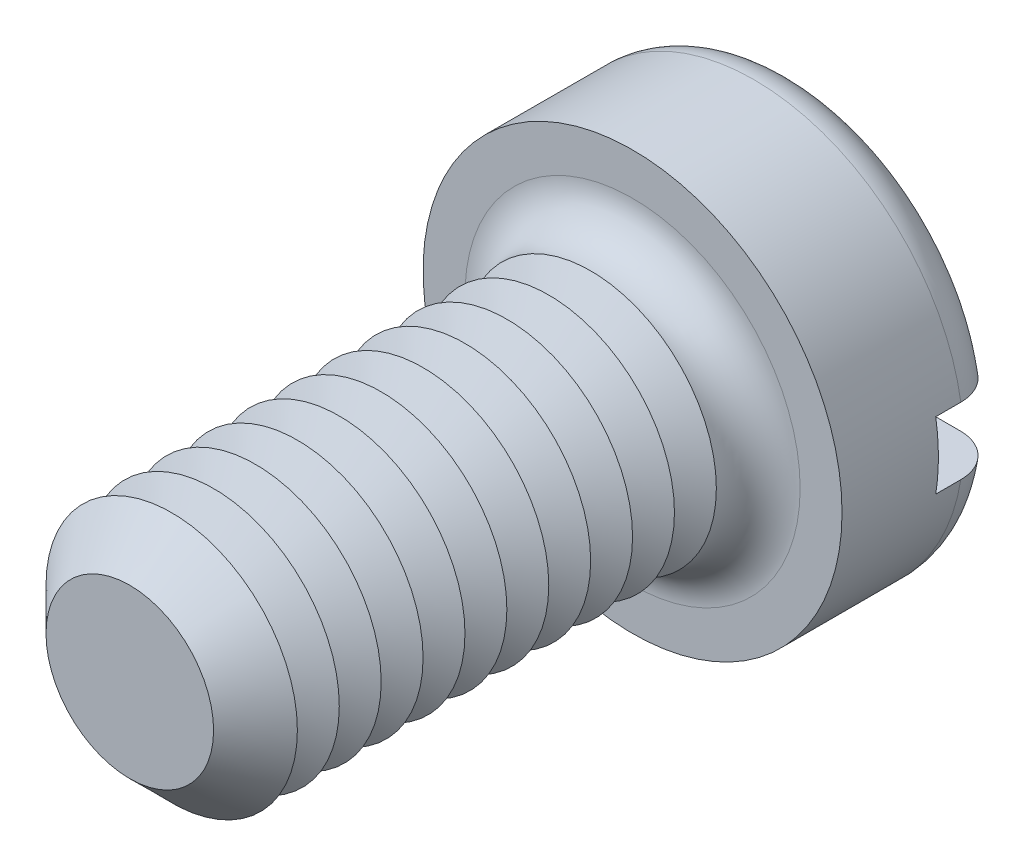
from build123d import *

# Parameters (mm, degrees)
SKETCH3_R           = 5
BOSS_EXTRUDE2_DEPTH = 3.9
SKETCH4_R           = 3
BOSS_EXTRUDE3_DEPTH = 12
FILLET1_R           = 1
CHAMFER1_SIZE       = 1
LPATTERN1_COUNT     = 10
LPATTERN1_PITCH     = 1
SKETCH8_W           = 10
SKETCH8_H           = 1.6
CUT_EXTRUDE1_DEPTH  = 1.6


with BuildPart() as part:
    # Sketch3 → Boss-Extrude2 (new body)
    with BuildSketch(Plane.XY):
        Circle(SKETCH3_R)
    extrude(amount=-BOSS_EXTRUDE2_DEPTH)

    # Sketch4 → Boss-Extrude3 (add)
    with BuildSketch(Plane.XY):
        Circle(SKETCH4_R)
    extrude(amount=BOSS_EXTRUDE3_DEPTH)

    # Fillet1
    fillet1_edges = [part.edges().sort_by_distance(p)[0] for p in [
        (-5, 0, -3.9),
        (-3, 0, 0),
    ]]
    fillet(fillet1_edges, radius=FILLET1_R)

    # Chamfer1
    chamfer1_edges = [part.edges().sort_by_distance(p)[0] for p in [
        (-3, 0, 12),
    ]]
    chamfer(chamfer1_edges, length=CHAMFER1_SIZE)

    # Sketch6 → Cut-Revolve1 (revolve, cut)
    with BuildSketch(Plane(origin=(0, 0, 0), x_dir=(0, 0, -1), z_dir=(1, 0, 0)), mode=Mode.PRIVATE) as cut_revolve1_sk:
        Polygon((-1, 3), (-1.5, 2.133974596), (-2, 3), align=None)
    cut_revolve1 = revolve(cut_revolve1_sk.sketch.rotate(Axis((0, 0, -1.694361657), (0, 0, 1)), 90), axis=Axis((0, 0, -1.694361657), (0, 0, 1)), mode=Mode.SUBTRACT)

    # LPattern1: Cut-Revolve1 ×10
    with Locations(*[(0, 0, i * LPATTERN1_PITCH) for i in range(1, LPATTERN1_COUNT)]):
        add(cut_revolve1, mode=Mode.SUBTRACT)

    # Sketch8 → Cut-Extrude1 (cut)
    with BuildSketch(Plane(origin=(0, 0, -3.9), x_dir=(-1, 0, 0), z_dir=(0, 0, -1))):
        Rectangle(SKETCH8_W, SKETCH8_H)
    extrude(amount=-CUT_EXTRUDE1_DEPTH, mode=Mode.SUBTRACT)


solid = part.part
